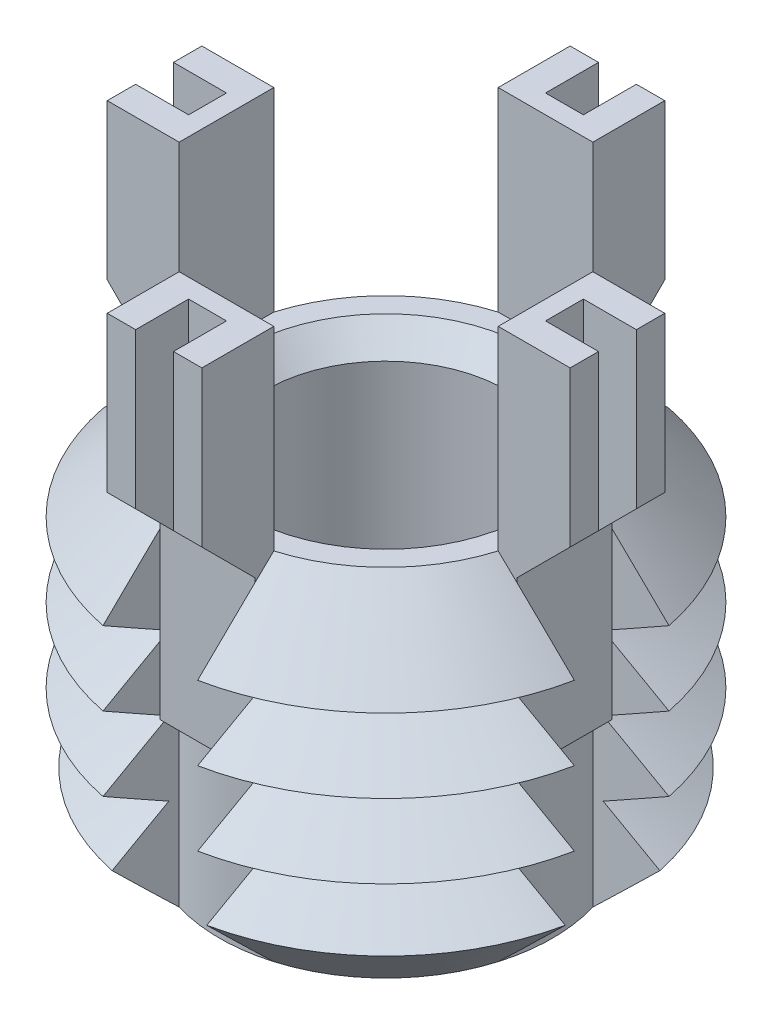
from build123d import *

# Parameters (mm, degrees)
SKETCH1_R               = 6.35
BOSS_EXTRUDE1_DEPTH     = 9.398
CHAMFER1_SIZE           = 1.954
LPATTERN1_COUNT         = 3
LPATTERN1_PITCH         = 1.954
CUT_EXTRUDE1_REACH      = 14.999
CIRPATTERN1_COUNT       = 4
BOSS_EXTRUDE3_DEPTH     = 1.25
CIRPATTERN2_COUNT       = 4
CUT_EXTRUDE3_DEPTH      = 17.994566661
CUT_EXTRUDE3_DEPTH_BACK = 17.994566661
SKETCH6_W               = 1.4
SKETCH6_H               = 1
SKETCH6_W_2             = 1
SKETCH6_H_2             = 1.4
SKETCH7_R               = 3.175
CUT_EXTRUDE4_DEPTH      = 9.398
CHAMFER2_SIZE           = 0.635


with BuildPart() as part:
    # Sketch1 → Boss-Extrude1 (new body)
    with BuildSketch(Plane(origin=(0, 0, 0), x_dir=(1, 0, 0), z_dir=(0, 1, 0))):
        with Locations(Location((0, 0, 0), (0, 0, 270))):
            Circle(SKETCH1_R)
    extrude(amount=-BOSS_EXTRUDE1_DEPTH)

    # Chamfer1
    chamfer1_edges = [part.edges().sort_by_distance(p)[0] for p in [
        (0, 0, -6.35),
        (0, -9.398, -6.35),
    ]]
    chamfer(chamfer1_edges, length=CHAMFER1_SIZE)

    # Sketch3 → Cut-Revolve1 (revolve, cut)
    with BuildSketch(Plane(origin=(0, 0, 0), x_dir=(0, 0, -1), z_dir=(1, 0, 0))):
        Polygon((-6.35, -1.954), (-4.657786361, -2.931), (-6.35, -3.908), align=None)
    cut_revolve1 = revolve(axis=Axis((0, 0.885892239, 0), (0, -1, 0)), mode=Mode.SUBTRACT)

    # LPattern1: Cut-Revolve1 ×3
    with Locations(*[(0, -i * LPATTERN1_PITCH, 0) for i in range(1, LPATTERN1_COUNT)]):
        add(cut_revolve1, mode=Mode.SUBTRACT)

    # Cut-Extrude1: up to this cone (the profile starts inside it)
    cut_extrude1_end = Plane(origin=(0, 0, 0), z_dir=(0, 1, 0)).offset(-13.793999) * Cone(1e-06, 43.087, 43.086999, align=(Align.CENTER, Align.CENTER, Align.MIN), mode=Mode.PRIVATE)
    # Sketch4 → Cut-Extrude1 (cut, up to the surface)
    with BuildSketch(Plane(origin=(0, 0, 0), x_dir=(1, 0, 0), z_dir=(0, 1, 0)), mode=Mode.PRIVATE) as cut_extrude1_sk1:
        with BuildLine():
            Line((-4.214536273, 1.25), (-6.225752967, 1.25))
            ThreePointArc((-6.225752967, 1.25), (-6.35, 0), (-6.225752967, -1.25))
            Line((-6.225752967, -1.25), (-4.214536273, -1.25))
            ThreePointArc((-4.214536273, -1.25), (-4.396, 0), (-4.214536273, 1.25))
        make_face()
    cut_extrude1_tool1 = extrude(cut_extrude1_sk1.sketch, amount=-CUT_EXTRUDE1_REACH, mode=Mode.PRIVATE) & cut_extrude1_end
    cut_extrude1 = cut_extrude1_tool1.solids().sort_by_distance((-5.321994, 0, 0))[0]
    add(cut_extrude1, mode=Mode.SUBTRACT)

    # CirPattern1: Cut-Extrude1 ×4 about axis
    cirpattern1_axis = Axis((0, 0, 0), (0, 1, 0))
    for i in range(1, CIRPATTERN1_COUNT):
        add(cut_extrude1.rotate(cirpattern1_axis, i * 360 / CIRPATTERN1_COUNT), mode=Mode.SUBTRACT)

    # Sketch5 → Boss-Extrude3 (add, symmetric)
    with BuildSketch(Plane(origin=(0, 0, 0), x_dir=(0, 0, -1), z_dir=(1, 0, 0))):
        Polygon((-4.214536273, 5.138), (-4.214536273, -4.862), (-4.714536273, -4.862), (-4.714536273, -0.362), (-6.114536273, 1.038), (-6.114536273, 5.138), align=None)
    boss_extrude3 = extrude(amount=BOSS_EXTRUDE3_DEPTH, both=True)

    # CirPattern2: Boss-Extrude3 ×4 about axis
    cirpattern2_axis = Axis((0, 0, 0), (0, 1, 0))
    for i in range(1, CIRPATTERN2_COUNT):
        add(boss_extrude3.rotate(cirpattern2_axis, i * 360 / CIRPATTERN2_COUNT))

    # Sketch6 → Cut-Extrude3 (cut, two sides: drawn at the far end of the back side and taken through both)
    with BuildSketch(Plane(origin=(0, 5.138, 0), x_dir=(1, 0, 0), z_dir=(0, 1, 0)).offset(-CUT_EXTRUDE3_DEPTH_BACK)):
        with Locations((-5.414536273, 0)):
            Rectangle(SKETCH6_W, SKETCH6_H)
        with Locations((0, 5.414536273)):
            Rectangle(SKETCH6_W_2, SKETCH6_H_2)
        with Locations((5.414536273, 0)):
            Rectangle(SKETCH6_W, SKETCH6_H)
        with Locations((0, -5.414536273)):
            Rectangle(SKETCH6_W_2, SKETCH6_H_2)
    extrude(amount=CUT_EXTRUDE3_DEPTH + CUT_EXTRUDE3_DEPTH_BACK, mode=Mode.SUBTRACT)

    # Sketch7 → Cut-Extrude4 (cut)
    with BuildSketch(Plane(origin=(0, 0, 0), x_dir=(1, 0, 0), z_dir=(0, 1, 0))):
        with Locations(Location((0, 0, 0), (0, 0, 270))):
            Circle(SKETCH7_R)
    extrude(amount=-CUT_EXTRUDE4_DEPTH, mode=Mode.SUBTRACT)

    # Chamfer2
    chamfer2_edges = [part.edges().sort_by_distance(p)[0] for p in [
        (0, 0, -3.175),
        (0, -9.398, -3.175),
    ]]
    chamfer(chamfer2_edges, length=CHAMFER2_SIZE)


solid = part.part
